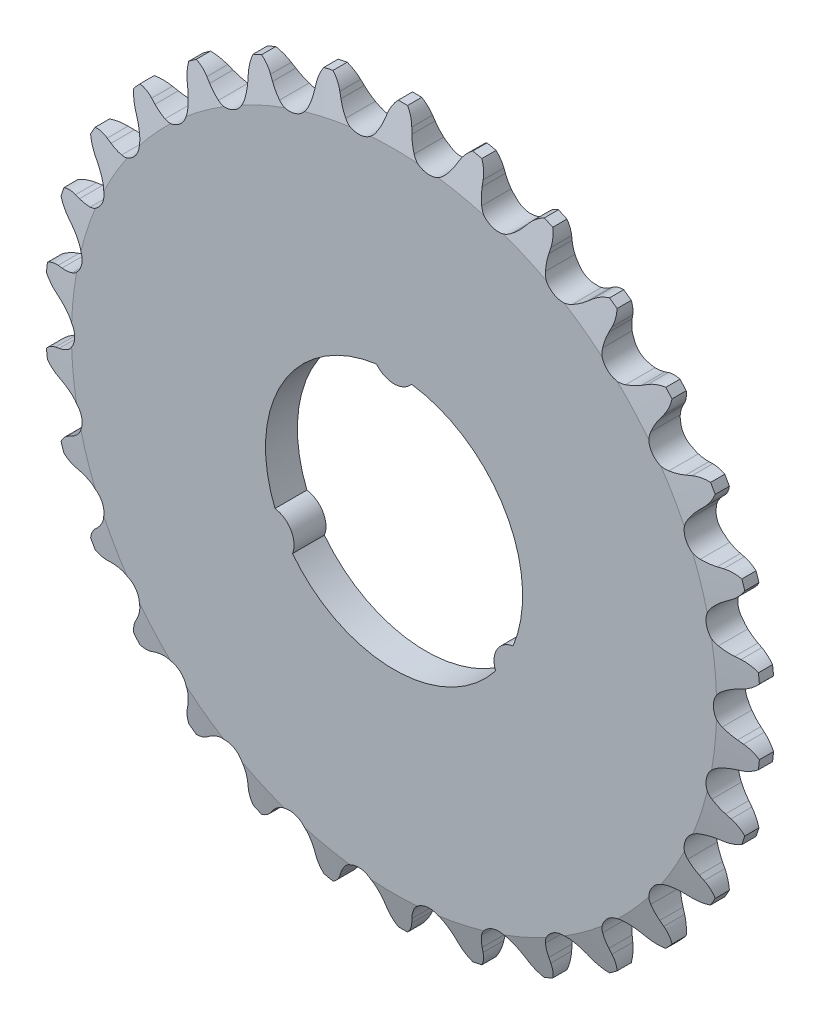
from build123d import *

# Parameters (mm, degrees)
CUT_EXTRUDE1_DEPTH      = 69.15599042
CIRPATTERN1_COUNT       = 30
BOSS_EXTRUDE1_START     = 2.1463
SKETCH2_R               = 25.4
BOSS_EXTRUDE1_DEPTH     = 17.9324
CUT_EXTRUDE2_DEPTH      = 71.882481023
CUT_EXTRUDE2_DEPTH_BACK = 71.882481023
SKETCH3_R               = 6.35
SKETCH4_W               = 3.21945
SKETCH4_H               = 8.001
CUT_EXTRUDE3_DEPTH      = 72.520084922
SKETCH6_R               = 35.116728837
CUT_EXTRUDE5_DEPTH      = 17.9324


with BuildPart() as part:
    # Sketch1 → Revolve1 (revolve)
    with BuildSketch(Plane(origin=(0, 0, 0), x_dir=(0, 0, -1), z_dir=(1, 0, 0)), mode=Mode.PRIVATE) as revolve1_sk:
        Polygon((2.1463, 0), (-2.1463, 0), (-2.1463, 43.407160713), (-0.955675, 48.169660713), (0.955675, 48.169660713), (2.1463, 43.407160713), align=None)
    revolve(revolve1_sk.sketch.rotate(Axis((0, 0, -2.1463), (0, 0, 1)), 90), axis=Axis((0, 0, -2.1463), (0, 0, 1)))

    # Sketch0 → Cut-Extrude1 (cut, symmetric)
    with BuildSketch(Plane.XY):
        with BuildLine():
            Line((8.041048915, -45.6967776), (7.726763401, -45.076392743))
            ThreePointArc((7.726763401, -45.076392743), (7.246009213, -44.27311103), (6.65729117, -43.545239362))
            ThreePointArc((6.65729117, -43.545239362), (4.491687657, -42.735553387), (2.541750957, -43.977800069))
            ThreePointArc((2.541750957, -43.977800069), (2.117230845, -44.812167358), (1.813993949, -45.697849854))
            Line((1.813993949, -45.697849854), (1.635561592, -46.370021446))
            ThreePointArc((1.635561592, -46.370021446), (0.078789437, -48.644306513), (-2.563000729, -49.42970885))
            ThreePointArc((-2.563000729, -49.42970885), (5.173752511, -49.224966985), (12.784007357, -47.816673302))
            ThreePointArc((12.784007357, -47.816673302), (10.036652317, -47.59769295), (8.041048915, -45.6967776))
        make_face()
    cut_extrude1 = extrude(amount=CUT_EXTRUDE1_DEPTH, both=True, mode=Mode.SUBTRACT)

    # CirPattern1: Cut-Extrude1 ×30 about axis
    cirpattern1_axis = Axis((0, 0, 0), (0, 0, 1))
    for i in range(1, CIRPATTERN1_COUNT):
        add(cut_extrude1.rotate(cirpattern1_axis, i * 360 / CIRPATTERN1_COUNT), mode=Mode.SUBTRACT)

    # Sketch2 → Boss-Extrude1 (add)
    with BuildSketch(Plane.XY.offset(BOSS_EXTRUDE1_START)):
        Circle(SKETCH2_R)
    extrude(amount=BOSS_EXTRUDE1_DEPTH)

    # Sketch3 → Cut-Extrude2 (cut, two sides: drawn at the far end of the back side and taken through both)
    with BuildSketch(Plane.XY.offset(-CUT_EXTRUDE2_DEPTH_BACK)):
        with Locations(Location((0, 0, 0), (0, 0, 180))):
            Circle(SKETCH3_R)
    extrude(amount=CUT_EXTRUDE2_DEPTH + CUT_EXTRUDE2_DEPTH_BACK, mode=Mode.SUBTRACT)

    # Sketch4 → Cut-Revolve1 (revolve, cut)
    with BuildSketch(Plane(origin=(0, 0, 0), x_dir=(0, 0, -1), z_dir=(1, 0, 0))):
        Polygon((-20.0787, 25.4), (-20.0787, 24.765), (-19.4437, 25.4), align=None)
        with Locations((-3.756025, 44.169160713)):
            Rectangle(SKETCH4_W, SKETCH4_H)
    revolve(axis=Axis((0, 0, -2.1463), (0, 0, 1)), mode=Mode.SUBTRACT)

    # Sketch5 → Cut-Extrude3 (cut, through all)
    with BuildSketch(Plane(origin=(0, 0, -2.1463), x_dir=(-1, 0, 0), z_dir=(0, 0, -1))):
        with BuildLine():
            ThreePointArc((-2.353181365, 17.139210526), (0, 16), (2.353181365, 17.139210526))
            ThreePointArc((2.353181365, 17.139210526), (14.98206146, 8.650308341), (16.019851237, -6.531031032))
            ThreePointArc((16.019851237, -6.531031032), (13.857845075, -7.999358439), (13.667654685, -10.605904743))
            ThreePointArc((13.667654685, -10.605904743), (0.002037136, -17.29999988), (-13.66515654, -10.609123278))
            ThreePointArc((-13.66515654, -10.609123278), (-13.855015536, -8.000712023), (-16.019277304, -6.532438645))
            ThreePointArc((-16.019277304, -6.532438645), (-14.98244149, 8.649650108), (-2.353181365, 17.139210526))
        make_face()
    extrude(amount=-CUT_EXTRUDE3_DEPTH, mode=Mode.SUBTRACT)

    # Sketch6 → Cut-Extrude5 (cut)
    with BuildSketch(Plane.XY.offset(2.1463)):
        Circle(SKETCH6_R)
    extrude(amount=CUT_EXTRUDE5_DEPTH, mode=Mode.SUBTRACT)


solid = part.part
